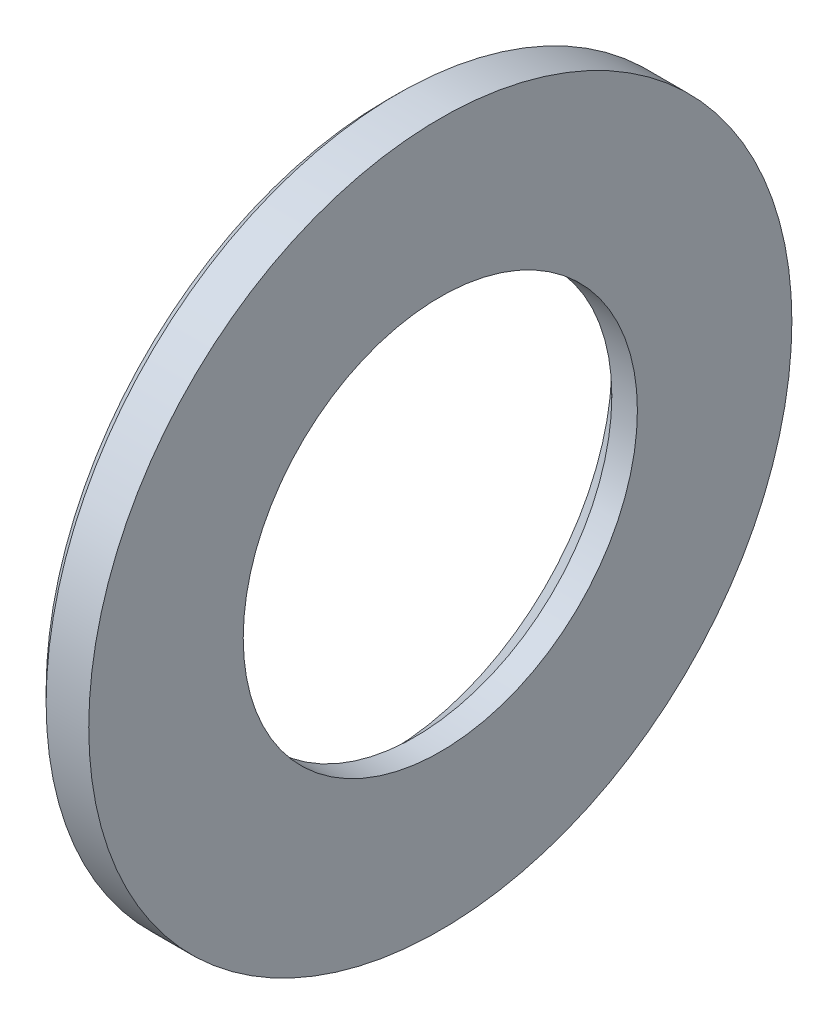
ISO-10303-21;
HEADER;
FILE_DESCRIPTION(('STEP AP214'),'2;1');
FILE_NAME('part.step','',(''),(''),'','','');
FILE_SCHEMA(('AUTOMOTIVE_DESIGN { 1 0 10303 214 1 1 1 1 }'));
ENDSEC;
DATA;
#1=APPLICATION_CONTEXT('core data for automotive mechanical design processes');
#2=APPLICATION_PROTOCOL_DEFINITION('international standard','automotive_design',2000,#1);
#3=PRODUCT_CONTEXT('',#1,'mechanical');
#4=PRODUCT('Part','Part','',(#3));
#5=PRODUCT_RELATED_PRODUCT_CATEGORY('part','',(#4));
#6=PRODUCT_DEFINITION_FORMATION('','',#4);
#7=PRODUCT_DEFINITION_CONTEXT('part definition',#1,'design');
#8=PRODUCT_DEFINITION('design','',#6,#7);
#9=PRODUCT_DEFINITION_SHAPE('','',#8);
#10=(LENGTH_UNIT() NAMED_UNIT(*) SI_UNIT(.MILLI.,.METRE.));
#11=(NAMED_UNIT(*) PLANE_ANGLE_UNIT() SI_UNIT($,.RADIAN.));
#12=(NAMED_UNIT(*) SI_UNIT($,.STERADIAN.) SOLID_ANGLE_UNIT());
#13=UNCERTAINTY_MEASURE_WITH_UNIT(LENGTH_MEASURE(1.E-05),#10,'distance_accuracy_value','');
#14=(GEOMETRIC_REPRESENTATION_CONTEXT(3) GLOBAL_UNCERTAINTY_ASSIGNED_CONTEXT((#13)) GLOBAL_UNIT_ASSIGNED_CONTEXT((#10,
#11,#12)) REPRESENTATION_CONTEXT('',''));
#15=CARTESIAN_POINT('',(0.,0.,0.));
#16=DIRECTION('',(0.,0.,1.));
#17=DIRECTION('',(1.,0.,0.));
#18=AXIS2_PLACEMENT_3D('',#15,#16,#17);
#19=CARTESIAN_POINT('',(-34.9249999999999,0.,0.));
#20=DIRECTION('',(-1.,0.,0.));
#21=DIRECTION('',(0.,0.,1.));
#22=AXIS2_PLACEMENT_3D('',#19,#20,#21);
#23=CYLINDRICAL_SURFACE('',#22,18.5);
#24=CARTESIAN_POINT('',(0.,0.,0.));
#25=DIRECTION('',(-1.,0.,0.));
#26=DIRECTION('',(0.,0.,1.));
#27=AXIS2_PLACEMENT_3D('',#24,#25,#26);
#28=CIRCLE('',#27,18.5);
#29=CARTESIAN_POINT('',(0.,0.,18.5));
#30=VERTEX_POINT('',#29);
#31=EDGE_CURVE('E10',#30,#30,#28,.T.);
#32=ORIENTED_EDGE('',*,*,#31,.F.);
#33=EDGE_LOOP('',(#32));
#34=FACE_BOUND('',#33,.T.);
#35=CARTESIAN_POINT('',(-2.4,0.,0.));
#36=DIRECTION('',(-1.,0.,0.));
#37=DIRECTION('',(0.,0.,1.));
#38=AXIS2_PLACEMENT_3D('',#35,#36,#37);
#39=CIRCLE('',#38,18.5);
#40=CARTESIAN_POINT('',(-2.4,0.,18.5));
#41=VERTEX_POINT('',#40);
#42=EDGE_CURVE('E53',#41,#41,#39,.T.);
#43=ORIENTED_EDGE('',*,*,#42,.T.);
#44=EDGE_LOOP('',(#43));
#45=FACE_BOUND('',#44,.T.);
#46=ADVANCED_FACE('F31',(#34,#45),#23,.F.);
#47=CARTESIAN_POINT('',(0.,18.5,0.));
#48=DIRECTION('',(-1.,0.,0.));
#49=DIRECTION('',(0.,0.,1.));
#50=AXIS2_PLACEMENT_3D('',#47,#48,#49);
#51=PLANE('',#50);
#52=CARTESIAN_POINT('',(0.,0.,0.));
#53=DIRECTION('',(-1.,0.,0.));
#54=DIRECTION('',(0.,0.,1.));
#55=AXIS2_PLACEMENT_3D('',#52,#53,#54);
#56=CIRCLE('',#55,33.);
#57=CARTESIAN_POINT('',(0.,0.,33.));
#58=VERTEX_POINT('',#57);
#59=EDGE_CURVE('E37',#58,#58,#56,.T.);
#60=ORIENTED_EDGE('',*,*,#59,.F.);
#61=EDGE_LOOP('',(#60));
#62=FACE_BOUND('',#61,.T.);
#63=ORIENTED_EDGE('',*,*,#31,.T.);
#64=EDGE_LOOP('',(#63));
#65=FACE_BOUND('',#64,.T.);
#66=ADVANCED_FACE('F70',(#62,#65),#51,.F.);
#67=CARTESIAN_POINT('',(-34.9249999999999,0.,0.));
#68=DIRECTION('',(-1.,0.,0.));
#69=DIRECTION('',(0.,0.,1.));
#70=AXIS2_PLACEMENT_3D('',#67,#68,#69);
#71=CYLINDRICAL_SURFACE('',#70,33.);
#72=CARTESIAN_POINT('',(-4.,0.,0.));
#73=DIRECTION('',(-1.,0.,0.));
#74=DIRECTION('',(0.,0.,1.));
#75=AXIS2_PLACEMENT_3D('',#72,#73,#74);
#76=CIRCLE('',#75,33.);
#77=CARTESIAN_POINT('',(-4.,0.,33.));
#78=VERTEX_POINT('',#77);
#79=EDGE_CURVE('E41',#78,#78,#76,.T.);
#80=ORIENTED_EDGE('',*,*,#79,.F.);
#81=EDGE_LOOP('',(#80));
#82=FACE_BOUND('',#81,.T.);
#83=ORIENTED_EDGE('',*,*,#59,.T.);
#84=EDGE_LOOP('',(#83));
#85=FACE_BOUND('',#84,.T.);
#86=ADVANCED_FACE('F75',(#82,#85),#71,.T.);
#87=CARTESIAN_POINT('',(-5.,0.,0.));
#88=DIRECTION('',(1.,0.,0.));
#89=DIRECTION('',(0.,0.,-1.));
#90=AXIS2_PLACEMENT_3D('',#87,#88,#89);
#91=CONICAL_SURFACE('',#90,32.,0.785398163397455);
#92=ORIENTED_EDGE('',*,*,#79,.T.);
#93=EDGE_LOOP('',(#92));
#94=FACE_BOUND('',#93,.T.);
#95=CARTESIAN_POINT('',(-5.,0.,0.));
#96=DIRECTION('',(-1.,0.,0.));
#97=DIRECTION('',(0.,0.,1.));
#98=AXIS2_PLACEMENT_3D('',#95,#96,#97);
#99=CIRCLE('',#98,32.);
#100=CARTESIAN_POINT('',(-5.,0.,32.));
#101=VERTEX_POINT('',#100);
#102=EDGE_CURVE('E45',#101,#101,#99,.T.);
#103=ORIENTED_EDGE('',*,*,#102,.F.);
#104=EDGE_LOOP('',(#103));
#105=FACE_BOUND('',#104,.T.);
#106=ADVANCED_FACE('F66',(#94,#105),#91,.T.);
#107=CARTESIAN_POINT('',(-5.,32.,0.));
#108=DIRECTION('',(1.,0.,0.));
#109=DIRECTION('',(0.,0.,-1.));
#110=AXIS2_PLACEMENT_3D('',#107,#108,#109);
#111=PLANE('',#110);
#112=CARTESIAN_POINT('',(-5.,0.,0.));
#113=DIRECTION('',(-1.,0.,0.));
#114=DIRECTION('',(0.,0.,1.));
#115=AXIS2_PLACEMENT_3D('',#112,#113,#114);
#116=CIRCLE('',#115,21.1);
#117=CARTESIAN_POINT('',(-5.,0.,21.1));
#118=VERTEX_POINT('',#117);
#119=EDGE_CURVE('E50',#118,#118,#116,.T.);
#120=ORIENTED_EDGE('',*,*,#119,.F.);
#121=EDGE_LOOP('',(#120));
#122=FACE_BOUND('',#121,.T.);
#123=ORIENTED_EDGE('',*,*,#102,.T.);
#124=EDGE_LOOP('',(#123));
#125=FACE_BOUND('',#124,.T.);
#126=ADVANCED_FACE('F60',(#122,#125),#111,.F.);
#127=CARTESIAN_POINT('',(-2.4,0.,0.));
#128=DIRECTION('',(-1.,0.,0.));
#129=DIRECTION('',(0.,0.,1.));
#130=AXIS2_PLACEMENT_3D('',#127,#128,#129);
#131=CONICAL_SURFACE('',#130,18.5,0.785398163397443);
#132=ORIENTED_EDGE('',*,*,#119,.T.);
#133=EDGE_LOOP('',(#132));
#134=FACE_BOUND('',#133,.T.);
#135=ORIENTED_EDGE('',*,*,#42,.F.);
#136=EDGE_LOOP('',(#135));
#137=FACE_BOUND('',#136,.T.);
#138=ADVANCED_FACE('F58',(#134,#137),#131,.F.);
#139=CLOSED_SHELL('',(#46,#66,#86,#106,#126,#138));
#140=MANIFOLD_SOLID_BREP('B2',#139);
#141=ADVANCED_BREP_SHAPE_REPRESENTATION('',(#18,#140),#14);
#142=SHAPE_DEFINITION_REPRESENTATION(#9,#141);
ENDSEC;
END-ISO-10303-21;
